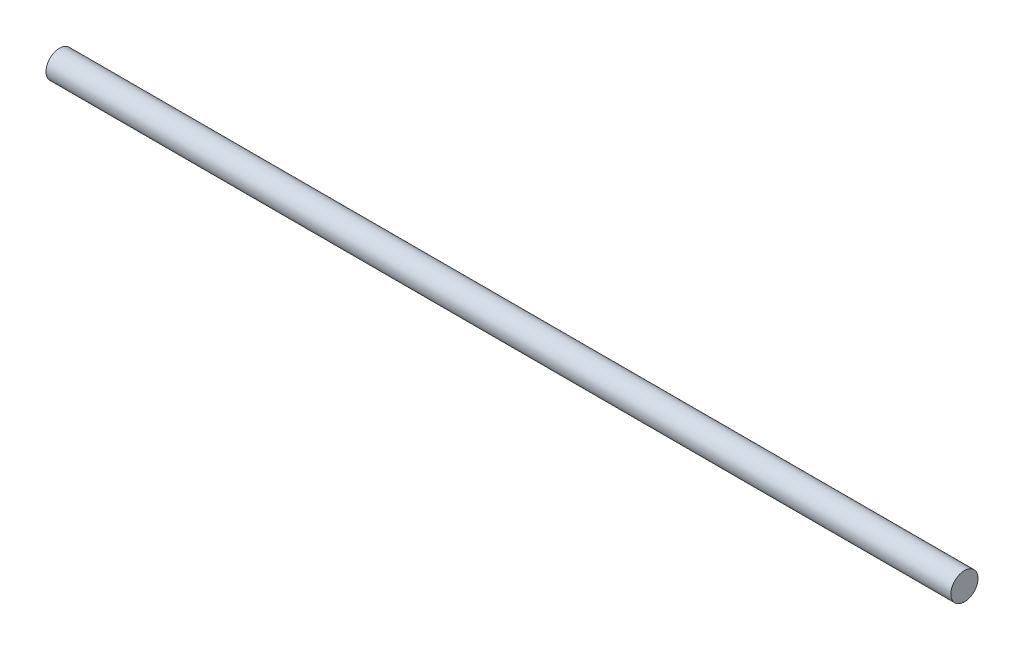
from build123d import *

# Parameters (mm, degrees)
SKETCH1_R           = 1.5
BOSS_EXTRUDE1_DEPTH = 100


with BuildPart() as part:
    # Sketch1 → Boss-Extrude1 (new body)
    with BuildSketch(Plane(origin=(0, 0, 0), x_dir=(0, 0, -1), z_dir=(1, 0, 0))):
        Circle(SKETCH1_R)
    extrude(amount=BOSS_EXTRUDE1_DEPTH)


solid = part.part
